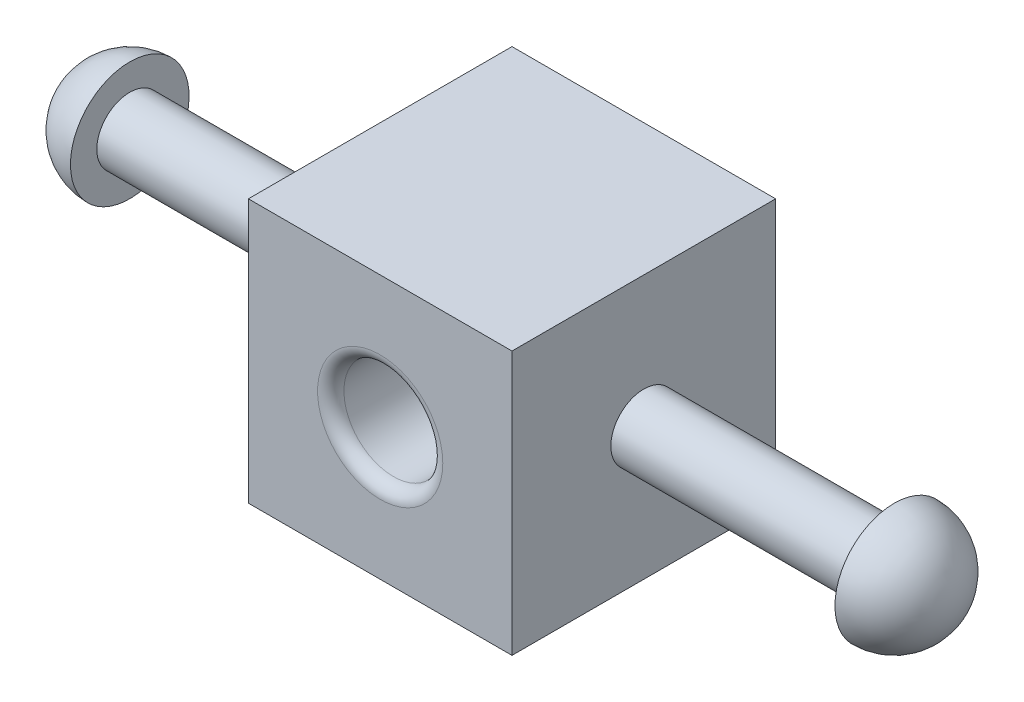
from build123d import *

# Parameters (mm, degrees)
SKETCH2_W           = 25.4
SKETCH2_H           = 25.4
BOSS_EXTRUDE1_DEPTH = 12.7
SKETCH3_R           = 4.7625
CUT_EXTRUDE1_DEPTH  = 56.681208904
FILLET1_R           = 1.27
FILLET2_R           = 1.27


with BuildPart() as part:
    # Sketch1 → Revolve1 (revolve)
    with BuildSketch(Plane.XY):
        with BuildLine():
            Line((36.83, 15.875), (-36.83, 15.875))
            Line((-36.83, 15.875), (-36.83, 18.415))
            ThreePointArc((-36.83, 18.415), (-40.871115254, 16.741115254), (-42.545, 12.7))
            Line((-42.545, 12.7), (42.545, 12.7))
            ThreePointArc((42.545, 12.7), (40.871115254, 16.741115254), (36.83, 18.415))
            Line((36.83, 18.415), (36.83, 15.875))
        make_face()
    revolve(axis=Axis((-42.545, 12.7, 0), (1, 0, 0)))


with BuildPart() as body_2:
    # Sketch2 → Boss-Extrude1 (new, symmetric)
    with BuildSketch(Plane.XY):
        with Locations((0, 12.7)):
            Rectangle(SKETCH2_W, SKETCH2_H)
    extrude(amount=BOSS_EXTRUDE1_DEPTH, both=True)


with BuildPart() as cut_extrude1_tool:
    # Sketch3 → Cut-Extrude1 (new, through all)
    with BuildSketch(Plane.XY.offset(12.7)):
        with Locations((0, 12.7)):
            Circle(SKETCH3_R)
    extrude(amount=-CUT_EXTRUDE1_DEPTH)


with BuildPart() as part_1:
    add(part.part)

    # Cut-Extrude1: cut by cut_extrude1_tool
    add(cut_extrude1_tool.part, mode=Mode.SUBTRACT)


with BuildPart() as body_2_1:
    add(body_2.part)

    # Cut-Extrude1: cut by cut_extrude1_tool
    add(cut_extrude1_tool.part, mode=Mode.SUBTRACT)

    # Fillet1
    fillet1_edges = [body_2_1.edges().sort_by_distance(p)[0] for p in [
        (-4.7625, 12.7, 12.7),
    ]]
    fillet(fillet1_edges, radius=FILLET1_R)

    # Fillet2
    fillet2_edges = [body_2_1.edges().sort_by_distance(p)[0] for p in [
        (-4.7625, 12.7, -12.7),
    ]]
    fillet(fillet2_edges, radius=FILLET2_R)


solid = Compound([part_1.part, body_2_1.part])
